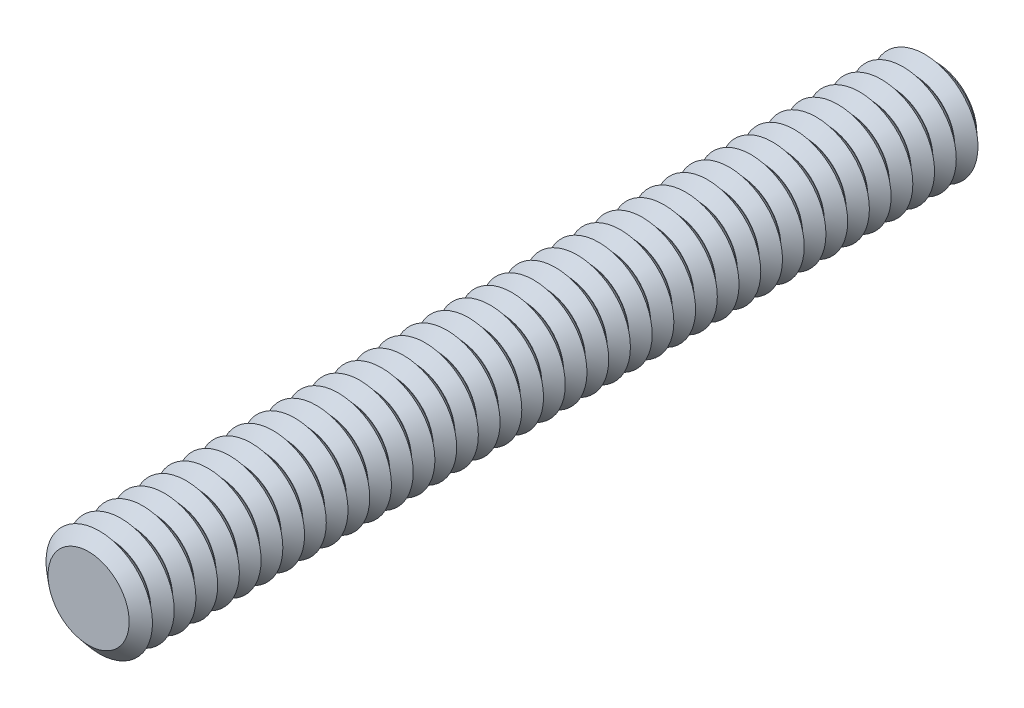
from build123d import *

# Parameters (mm, degrees)
SKETCH1_R       = 2.41935
EXTRUDE1_DEPTH  = 50.546
LPATTERN1_COUNT = 39
LPATTERN1_PITCH = 1.2954


with BuildPart() as part:
    # Sketch1 → Extrude1 (new body)
    with BuildSketch(Plane.XY):
        Circle(SKETCH1_R)
    extrude(amount=-EXTRUDE1_DEPTH)

    # Sketch2 → Revolve1 (revolve)
    with BuildSketch(Plane(origin=(0, 0, 0), x_dir=(0, 0, -1), z_dir=(1, 0, 0)), mode=Mode.PRIVATE) as revolve1_sk:
        Polygon((0, 2.41935), (0.635, 3.175), (1.27, 2.41935), align=None)
    revolve1 = revolve(revolve1_sk.sketch.rotate(Axis((0, 0, 0), (0, 0, 1)), 270), axis=Axis((0, 0, 0), (0, 0, 1)))

    # LPattern1: Revolve1 ×39
    with Locations(*[(0, 0, -i * LPATTERN1_PITCH) for i in range(1, LPATTERN1_COUNT)]):
        add(revolve1)


solid = part.part
